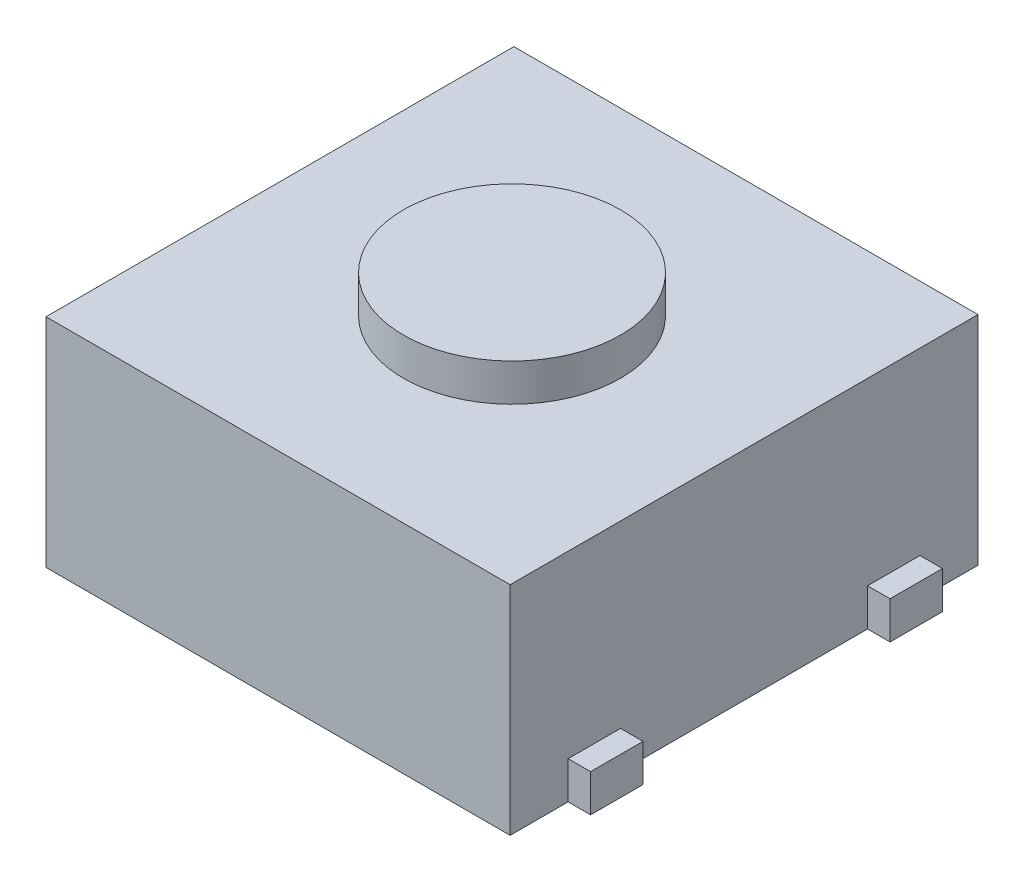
ISO-10303-21;
HEADER;
FILE_DESCRIPTION(('STEP AP214'),'2;1');
FILE_NAME('part.step','',(''),(''),'','','');
FILE_SCHEMA(('AUTOMOTIVE_DESIGN { 1 0 10303 214 1 1 1 1 }'));
ENDSEC;
DATA;
#1=APPLICATION_CONTEXT('core data for automotive mechanical design processes');
#2=APPLICATION_PROTOCOL_DEFINITION('international standard','automotive_design',2000,#1);
#3=PRODUCT_CONTEXT('',#1,'mechanical');
#4=PRODUCT('Part','Part','',(#3));
#5=PRODUCT_RELATED_PRODUCT_CATEGORY('part','',(#4));
#6=PRODUCT_DEFINITION_FORMATION('','',#4);
#7=PRODUCT_DEFINITION_CONTEXT('part definition',#1,'design');
#8=PRODUCT_DEFINITION('design','',#6,#7);
#9=PRODUCT_DEFINITION_SHAPE('','',#8);
#10=(LENGTH_UNIT() NAMED_UNIT(*) SI_UNIT(.MILLI.,.METRE.));
#11=(NAMED_UNIT(*) PLANE_ANGLE_UNIT() SI_UNIT($,.RADIAN.));
#12=(NAMED_UNIT(*) SI_UNIT($,.STERADIAN.) SOLID_ANGLE_UNIT());
#13=UNCERTAINTY_MEASURE_WITH_UNIT(LENGTH_MEASURE(1.E-05),#10,'distance_accuracy_value','');
#14=(GEOMETRIC_REPRESENTATION_CONTEXT(3) GLOBAL_UNCERTAINTY_ASSIGNED_CONTEXT((#13)) GLOBAL_UNIT_ASSIGNED_CONTEXT((#10,
#11,#12)) REPRESENTATION_CONTEXT('',''));
#15=CARTESIAN_POINT('',(0.,0.,0.));
#16=DIRECTION('',(0.,0.,1.));
#17=DIRECTION('',(1.,0.,0.));
#18=AXIS2_PLACEMENT_3D('',#15,#16,#17);
#19=CARTESIAN_POINT('',(0.,2.9,0.));
#20=DIRECTION('',(1.,0.,0.));
#21=DIRECTION('',(0.,0.,-1.));
#22=AXIS2_PLACEMENT_3D('',#19,#20,#21);
#23=PLANE('',#22);
#24=DIRECTION('',(0.,0.,-1.));
#25=VECTOR('',#24,1.);
#26=CARTESIAN_POINT('',(0.,0.5,0.));
#27=LINE('',#26,#25);
#28=CARTESIAN_POINT('',(0.,0.5,-4.775));
#29=VERTEX_POINT('',#28);
#30=CARTESIAN_POINT('',(0.,0.5,-5.475));
#31=VERTEX_POINT('',#30);
#32=EDGE_CURVE('E55',#29,#31,#27,.T.);
#33=ORIENTED_EDGE('',*,*,#32,.F.);
#34=DIRECTION('',(0.,-1.,0.));
#35=VECTOR('',#34,1.);
#36=CARTESIAN_POINT('',(0.,0.5,-4.775));
#37=LINE('',#36,#35);
#38=CARTESIAN_POINT('',(0.,0.,-4.775));
#39=VERTEX_POINT('',#38);
#40=EDGE_CURVE('E207',#29,#39,#37,.T.);
#41=ORIENTED_EDGE('',*,*,#40,.T.);
#42=DIRECTION('',(0.,0.,1.));
#43=VECTOR('',#42,1.);
#44=CARTESIAN_POINT('',(0.,0.,0.));
#45=LINE('',#44,#43);
#46=CARTESIAN_POINT('',(0.,0.,-1.475));
#47=VERTEX_POINT('',#46);
#48=EDGE_CURVE('E309',#39,#47,#45,.T.);
#49=ORIENTED_EDGE('',*,*,#48,.T.);
#50=DIRECTION('',(0.,-1.,0.));
#51=VECTOR('',#50,1.);
#52=CARTESIAN_POINT('',(0.,0.5,-1.475));
#53=LINE('',#52,#51);
#54=CARTESIAN_POINT('',(0.,0.5,-1.475));
#55=VERTEX_POINT('',#54);
#56=EDGE_CURVE('E233',#55,#47,#53,.T.);
#57=ORIENTED_EDGE('',*,*,#56,.F.);
#58=DIRECTION('',(0.,0.,-1.));
#59=VECTOR('',#58,1.);
#60=CARTESIAN_POINT('',(0.,0.5,0.));
#61=LINE('',#60,#59);
#62=CARTESIAN_POINT('',(0.,0.5,-0.775));
#63=VERTEX_POINT('',#62);
#64=EDGE_CURVE('E215',#63,#55,#61,.T.);
#65=ORIENTED_EDGE('',*,*,#64,.F.);
#66=DIRECTION('',(0.,-1.,0.));
#67=VECTOR('',#66,1.);
#68=CARTESIAN_POINT('',(0.,0.5,-0.775));
#69=LINE('',#68,#67);
#70=CARTESIAN_POINT('',(0.,0.,-0.775));
#71=VERTEX_POINT('',#70);
#72=EDGE_CURVE('E230',#63,#71,#69,.T.);
#73=ORIENTED_EDGE('',*,*,#72,.T.);
#74=CARTESIAN_POINT('',(0.,0.,0.));
#75=VERTEX_POINT('',#74);
#76=EDGE_CURVE('E286',#71,#75,#45,.T.);
#77=ORIENTED_EDGE('',*,*,#76,.T.);
#78=DIRECTION('',(0.,-1.,0.));
#79=VECTOR('',#78,1.);
#80=CARTESIAN_POINT('',(0.,2.9,0.));
#81=LINE('',#80,#79);
#82=CARTESIAN_POINT('',(0.,2.9,0.));
#83=VERTEX_POINT('',#82);
#84=EDGE_CURVE('E44',#83,#75,#81,.T.);
#85=ORIENTED_EDGE('',*,*,#84,.F.);
#86=DIRECTION('',(0.,0.,1.));
#87=VECTOR('',#86,1.);
#88=CARTESIAN_POINT('',(0.,2.9,0.));
#89=LINE('',#88,#87);
#90=CARTESIAN_POINT('',(0.,2.9,-6.25));
#91=VERTEX_POINT('',#90);
#92=EDGE_CURVE('E295',#91,#83,#89,.T.);
#93=ORIENTED_EDGE('',*,*,#92,.F.);
#94=DIRECTION('',(0.,-1.,0.));
#95=VECTOR('',#94,1.);
#96=CARTESIAN_POINT('',(0.,2.9,-6.25));
#97=LINE('',#96,#95);
#98=CARTESIAN_POINT('',(0.,0.,-6.25));
#99=VERTEX_POINT('',#98);
#100=EDGE_CURVE('E305',#91,#99,#97,.T.);
#101=ORIENTED_EDGE('',*,*,#100,.T.);
#102=CARTESIAN_POINT('',(0.,0.,-5.475));
#103=VERTEX_POINT('',#102);
#104=EDGE_CURVE('E306',#99,#103,#45,.T.);
#105=ORIENTED_EDGE('',*,*,#104,.T.);
#106=DIRECTION('',(0.,-1.,0.));
#107=VECTOR('',#106,1.);
#108=CARTESIAN_POINT('',(0.,0.5,-5.475));
#109=LINE('',#108,#107);
#110=EDGE_CURVE('E51',#31,#103,#109,.T.);
#111=ORIENTED_EDGE('',*,*,#110,.F.);
#112=EDGE_LOOP('',(#33,#41,#49,#57,#65,#73,#77,#85,#93,#101,#105,#111));
#113=FACE_BOUND('',#112,.T.);
#114=ADVANCED_FACE('F37',(#113),#23,.F.);
#115=CARTESIAN_POINT('',(6.2,2.9,0.));
#116=DIRECTION('',(-1.,0.,0.));
#117=DIRECTION('',(0.,0.,1.));
#118=AXIS2_PLACEMENT_3D('',#115,#116,#117);
#119=PLANE('',#118);
#120=DIRECTION('',(0.,0.,1.));
#121=VECTOR('',#120,1.);
#122=CARTESIAN_POINT('',(6.2,0.5,0.));
#123=LINE('',#122,#121);
#124=CARTESIAN_POINT('',(6.2,0.5,-1.475));
#125=VERTEX_POINT('',#124);
#126=CARTESIAN_POINT('',(6.2,0.5,-0.775));
#127=VERTEX_POINT('',#126);
#128=EDGE_CURVE('E243',#125,#127,#123,.T.);
#129=ORIENTED_EDGE('',*,*,#128,.F.);
#130=DIRECTION('',(0.,-1.,0.));
#131=VECTOR('',#130,1.);
#132=CARTESIAN_POINT('',(6.2,0.5,-1.475));
#133=LINE('',#132,#131);
#134=CARTESIAN_POINT('',(6.2,0.,-1.475));
#135=VERTEX_POINT('',#134);
#136=EDGE_CURVE('E259',#125,#135,#133,.T.);
#137=ORIENTED_EDGE('',*,*,#136,.T.);
#138=DIRECTION('',(0.,0.,-1.));
#139=VECTOR('',#138,1.);
#140=CARTESIAN_POINT('',(6.2,0.,0.));
#141=LINE('',#140,#139);
#142=CARTESIAN_POINT('',(6.2,0.,-4.775));
#143=VERTEX_POINT('',#142);
#144=EDGE_CURVE('E314',#135,#143,#141,.T.);
#145=ORIENTED_EDGE('',*,*,#144,.T.);
#146=DIRECTION('',(0.,-1.,0.));
#147=VECTOR('',#146,1.);
#148=CARTESIAN_POINT('',(6.2,0.5,-4.775));
#149=LINE('',#148,#147);
#150=CARTESIAN_POINT('',(6.2,0.5,-4.775));
#151=VERTEX_POINT('',#150);
#152=EDGE_CURVE('E290',#151,#143,#149,.T.);
#153=ORIENTED_EDGE('',*,*,#152,.F.);
#154=DIRECTION('',(0.,0.,1.));
#155=VECTOR('',#154,1.);
#156=CARTESIAN_POINT('',(6.2,0.5,0.));
#157=LINE('',#156,#155);
#158=CARTESIAN_POINT('',(6.2,0.5,-5.475));
#159=VERTEX_POINT('',#158);
#160=EDGE_CURVE('E272',#159,#151,#157,.T.);
#161=ORIENTED_EDGE('',*,*,#160,.F.);
#162=DIRECTION('',(0.,-1.,0.));
#163=VECTOR('',#162,1.);
#164=CARTESIAN_POINT('',(6.2,0.5,-5.475));
#165=LINE('',#164,#163);
#166=CARTESIAN_POINT('',(6.2,0.,-5.475));
#167=VERTEX_POINT('',#166);
#168=EDGE_CURVE('E287',#159,#167,#165,.T.);
#169=ORIENTED_EDGE('',*,*,#168,.T.);
#170=CARTESIAN_POINT('',(6.2,0.,-6.25));
#171=VERTEX_POINT('',#170);
#172=EDGE_CURVE('E311',#167,#171,#141,.T.);
#173=ORIENTED_EDGE('',*,*,#172,.T.);
#174=DIRECTION('',(0.,-1.,0.));
#175=VECTOR('',#174,1.);
#176=CARTESIAN_POINT('',(6.2,2.9,-6.25));
#177=LINE('',#176,#175);
#178=CARTESIAN_POINT('',(6.2,2.9,-6.25));
#179=VERTEX_POINT('',#178);
#180=EDGE_CURVE('E318',#179,#171,#177,.T.);
#181=ORIENTED_EDGE('',*,*,#180,.F.);
#182=DIRECTION('',(0.,0.,-1.));
#183=VECTOR('',#182,1.);
#184=CARTESIAN_POINT('',(6.2,2.9,0.));
#185=LINE('',#184,#183);
#186=CARTESIAN_POINT('',(6.2,2.9,0.));
#187=VERTEX_POINT('',#186);
#188=EDGE_CURVE('E301',#187,#179,#185,.T.);
#189=ORIENTED_EDGE('',*,*,#188,.F.);
#190=DIRECTION('',(0.,-1.,0.));
#191=VECTOR('',#190,1.);
#192=CARTESIAN_POINT('',(6.2,2.9,0.));
#193=LINE('',#192,#191);
#194=CARTESIAN_POINT('',(6.2,0.,0.));
#195=VERTEX_POINT('',#194);
#196=EDGE_CURVE('E321',#187,#195,#193,.T.);
#197=ORIENTED_EDGE('',*,*,#196,.T.);
#198=CARTESIAN_POINT('',(6.2,0.,-0.775));
#199=VERTEX_POINT('',#198);
#200=EDGE_CURVE('E312',#195,#199,#141,.T.);
#201=ORIENTED_EDGE('',*,*,#200,.T.);
#202=DIRECTION('',(0.,-1.,0.));
#203=VECTOR('',#202,1.);
#204=CARTESIAN_POINT('',(6.2,0.5,-0.775));
#205=LINE('',#204,#203);
#206=EDGE_CURVE('E262',#127,#199,#205,.T.);
#207=ORIENTED_EDGE('',*,*,#206,.F.);
#208=EDGE_LOOP('',(#129,#137,#145,#153,#161,#169,#173,#181,#189,#197,#201,#207));
#209=FACE_BOUND('',#208,.T.);
#210=ADVANCED_FACE('F339',(#209),#119,.F.);
#211=CARTESIAN_POINT('',(0.,2.9,0.));
#212=DIRECTION('',(0.,0.,-1.));
#213=DIRECTION('',(-1.,0.,0.));
#214=AXIS2_PLACEMENT_3D('',#211,#212,#213);
#215=PLANE('',#214);
#216=DIRECTION('',(1.,0.,0.));
#217=VECTOR('',#216,1.);
#218=CARTESIAN_POINT('',(0.,0.,0.));
#219=LINE('',#218,#217);
#220=EDGE_CURVE('E308',#75,#195,#219,.T.);
#221=ORIENTED_EDGE('',*,*,#220,.T.);
#222=ORIENTED_EDGE('',*,*,#196,.F.);
#223=DIRECTION('',(1.,0.,0.));
#224=VECTOR('',#223,1.);
#225=CARTESIAN_POINT('',(0.,2.9,0.));
#226=LINE('',#225,#224);
#227=EDGE_CURVE('E298',#83,#187,#226,.T.);
#228=ORIENTED_EDGE('',*,*,#227,.F.);
#229=ORIENTED_EDGE('',*,*,#84,.T.);
#230=EDGE_LOOP('',(#221,#222,#228,#229));
#231=FACE_BOUND('',#230,.T.);
#232=ADVANCED_FACE('F326',(#231),#215,.F.);
#233=CARTESIAN_POINT('',(0.,2.9,-6.25));
#234=DIRECTION('',(0.,0.,1.));
#235=DIRECTION('',(1.,0.,0.));
#236=AXIS2_PLACEMENT_3D('',#233,#234,#235);
#237=PLANE('',#236);
#238=DIRECTION('',(-1.,0.,0.));
#239=VECTOR('',#238,1.);
#240=CARTESIAN_POINT('',(0.,0.,-6.25));
#241=LINE('',#240,#239);
#242=EDGE_CURVE('E299',#171,#99,#241,.T.);
#243=ORIENTED_EDGE('',*,*,#242,.T.);
#244=ORIENTED_EDGE('',*,*,#100,.F.);
#245=DIRECTION('',(-1.,0.,0.));
#246=VECTOR('',#245,1.);
#247=CARTESIAN_POINT('',(0.,2.9,-6.25));
#248=LINE('',#247,#246);
#249=EDGE_CURVE('E303',#179,#91,#248,.T.);
#250=ORIENTED_EDGE('',*,*,#249,.F.);
#251=ORIENTED_EDGE('',*,*,#180,.T.);
#252=EDGE_LOOP('',(#243,#244,#250,#251));
#253=FACE_BOUND('',#252,.T.);
#254=ADVANCED_FACE('F363',(#253),#237,.F.);
#255=CARTESIAN_POINT('',(0.,2.9,0.));
#256=DIRECTION('',(0.,-1.,0.));
#257=DIRECTION('',(0.,0.,-1.));
#258=AXIS2_PLACEMENT_3D('',#255,#256,#257);
#259=PLANE('',#258);
#260=CARTESIAN_POINT('',(3.1,2.9,-3.125));
#261=DIRECTION('',(0.,-1.,0.));
#262=DIRECTION('',(0.,0.,-1.));
#263=AXIS2_PLACEMENT_3D('',#260,#261,#262);
#264=CIRCLE('',#263,1.45);
#265=CARTESIAN_POINT('',(3.1,2.9,-4.575));
#266=VERTEX_POINT('',#265);
#267=EDGE_CURVE('E12',#266,#266,#264,.F.);
#268=ORIENTED_EDGE('',*,*,#267,.F.);
#269=EDGE_LOOP('',(#268));
#270=FACE_BOUND('',#269,.T.);
#271=ORIENTED_EDGE('',*,*,#92,.T.);
#272=ORIENTED_EDGE('',*,*,#227,.T.);
#273=ORIENTED_EDGE('',*,*,#188,.T.);
#274=ORIENTED_EDGE('',*,*,#249,.T.);
#275=EDGE_LOOP('',(#271,#272,#273,#274));
#276=FACE_BOUND('',#275,.T.);
#277=ADVANCED_FACE('F404',(#270,#276),#259,.F.);
#278=CARTESIAN_POINT('',(0.,0.,0.));
#279=DIRECTION('',(0.,-1.,0.));
#280=DIRECTION('',(0.,0.,-1.));
#281=AXIS2_PLACEMENT_3D('',#278,#279,#280);
#282=PLANE('',#281);
#283=ORIENTED_EDGE('',*,*,#104,.F.);
#284=ORIENTED_EDGE('',*,*,#242,.F.);
#285=ORIENTED_EDGE('',*,*,#172,.F.);
#286=DIRECTION('',(1.,0.,0.));
#287=VECTOR('',#286,1.);
#288=CARTESIAN_POINT('',(0.,0.,-5.47499999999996));
#289=LINE('',#288,#287);
#290=CARTESIAN_POINT('',(6.5,0.,-5.475));
#291=VERTEX_POINT('',#290);
#292=EDGE_CURVE('E270',#167,#291,#289,.T.);
#293=ORIENTED_EDGE('',*,*,#292,.T.);
#294=DIRECTION('',(0.,0.,-1.));
#295=VECTOR('',#294,1.);
#296=CARTESIAN_POINT('',(6.50000000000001,0.,0.));
#297=LINE('',#296,#295);
#298=CARTESIAN_POINT('',(6.5,0.,-4.775));
#299=VERTEX_POINT('',#298);
#300=EDGE_CURVE('E258',#299,#291,#297,.T.);
#301=ORIENTED_EDGE('',*,*,#300,.F.);
#302=DIRECTION('',(1.,0.,0.));
#303=VECTOR('',#302,1.);
#304=CARTESIAN_POINT('',(0.,0.,-4.77499999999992));
#305=LINE('',#304,#303);
#306=EDGE_CURVE('E280',#143,#299,#305,.T.);
#307=ORIENTED_EDGE('',*,*,#306,.F.);
#308=ORIENTED_EDGE('',*,*,#144,.F.);
#309=DIRECTION('',(1.,0.,0.));
#310=VECTOR('',#309,1.);
#311=CARTESIAN_POINT('',(0.,0.,-1.47500000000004));
#312=LINE('',#311,#310);
#313=CARTESIAN_POINT('',(6.5,0.,-1.475));
#314=VERTEX_POINT('',#313);
#315=EDGE_CURVE('E241',#135,#314,#312,.T.);
#316=ORIENTED_EDGE('',*,*,#315,.T.);
#317=DIRECTION('',(0.,0.,-1.));
#318=VECTOR('',#317,1.);
#319=CARTESIAN_POINT('',(6.5,0.,0.));
#320=LINE('',#319,#318);
#321=CARTESIAN_POINT('',(6.5,0.,-0.775));
#322=VERTEX_POINT('',#321);
#323=EDGE_CURVE('E229',#322,#314,#320,.T.);
#324=ORIENTED_EDGE('',*,*,#323,.F.);
#325=DIRECTION('',(1.,0.,0.));
#326=VECTOR('',#325,1.);
#327=CARTESIAN_POINT('',(0.,0.,-0.775));
#328=LINE('',#327,#326);
#329=EDGE_CURVE('E252',#199,#322,#328,.T.);
#330=ORIENTED_EDGE('',*,*,#329,.F.);
#331=ORIENTED_EDGE('',*,*,#200,.F.);
#332=ORIENTED_EDGE('',*,*,#220,.F.);
#333=ORIENTED_EDGE('',*,*,#76,.F.);
#334=DIRECTION('',(-1.,0.,0.));
#335=VECTOR('',#334,1.);
#336=CARTESIAN_POINT('',(0.,0.,-0.775));
#337=LINE('',#336,#335);
#338=CARTESIAN_POINT('',(-0.299999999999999,0.,-0.775));
#339=VERTEX_POINT('',#338);
#340=EDGE_CURVE('E213',#71,#339,#337,.T.);
#341=ORIENTED_EDGE('',*,*,#340,.T.);
#342=DIRECTION('',(0.,0.,1.));
#343=VECTOR('',#342,1.);
#344=CARTESIAN_POINT('',(-0.299999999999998,0.,0.));
#345=LINE('',#344,#343);
#346=CARTESIAN_POINT('',(-0.299999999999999,0.,-1.475));
#347=VERTEX_POINT('',#346);
#348=EDGE_CURVE('E206',#347,#339,#345,.T.);
#349=ORIENTED_EDGE('',*,*,#348,.F.);
#350=DIRECTION('',(-1.,0.,0.));
#351=VECTOR('',#350,1.);
#352=CARTESIAN_POINT('',(0.,0.,-1.475));
#353=LINE('',#352,#351);
#354=EDGE_CURVE('E223',#47,#347,#353,.T.);
#355=ORIENTED_EDGE('',*,*,#354,.F.);
#356=ORIENTED_EDGE('',*,*,#48,.F.);
#357=DIRECTION('',(-1.,0.,0.));
#358=VECTOR('',#357,1.);
#359=CARTESIAN_POINT('',(0.,0.,-4.775));
#360=LINE('',#359,#358);
#361=CARTESIAN_POINT('',(-0.299999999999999,0.,-4.775));
#362=VERTEX_POINT('',#361);
#363=EDGE_CURVE('E193',#39,#362,#360,.T.);
#364=ORIENTED_EDGE('',*,*,#363,.T.);
#365=DIRECTION('',(0.,0.,1.));
#366=VECTOR('',#365,1.);
#367=CARTESIAN_POINT('',(-0.300000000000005,0.,0.));
#368=LINE('',#367,#366);
#369=CARTESIAN_POINT('',(-0.299999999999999,0.,-5.475));
#370=VERTEX_POINT('',#369);
#371=EDGE_CURVE('E202',#370,#362,#368,.T.);
#372=ORIENTED_EDGE('',*,*,#371,.F.);
#373=DIRECTION('',(-1.,0.,0.));
#374=VECTOR('',#373,1.);
#375=CARTESIAN_POINT('',(0.,0.,-5.475));
#376=LINE('',#375,#374);
#377=EDGE_CURVE('E184',#103,#370,#376,.T.);
#378=ORIENTED_EDGE('',*,*,#377,.F.);
#379=EDGE_LOOP('',(#283,#284,#285,#293,#301,#307,#308,#316,#324,#330,#331,#332,#333,#341,#349,
#355,#356,#364,#372,#378));
#380=FACE_BOUND('',#379,.T.);
#381=ADVANCED_FACE('F335',(#380),#282,.T.);
#382=CARTESIAN_POINT('',(6.50000000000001,0.5,0.));
#383=DIRECTION('',(-1.,0.,0.));
#384=DIRECTION('',(0.,0.,1.));
#385=AXIS2_PLACEMENT_3D('',#382,#383,#384);
#386=PLANE('',#385);
#387=ORIENTED_EDGE('',*,*,#300,.T.);
#388=DIRECTION('',(0.,-1.,0.));
#389=VECTOR('',#388,1.);
#390=CARTESIAN_POINT('',(6.5,0.5,-5.475));
#391=LINE('',#390,#389);
#392=CARTESIAN_POINT('',(6.5,0.5,-5.475));
#393=VERTEX_POINT('',#392);
#394=EDGE_CURVE('E284',#393,#291,#391,.T.);
#395=ORIENTED_EDGE('',*,*,#394,.F.);
#396=DIRECTION('',(0.,0.,-1.));
#397=VECTOR('',#396,1.);
#398=CARTESIAN_POINT('',(6.50000000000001,0.5,0.));
#399=LINE('',#398,#397);
#400=CARTESIAN_POINT('',(6.5,0.5,-4.775));
#401=VERTEX_POINT('',#400);
#402=EDGE_CURVE('E267',#401,#393,#399,.T.);
#403=ORIENTED_EDGE('',*,*,#402,.F.);
#404=DIRECTION('',(0.,-1.,0.));
#405=VECTOR('',#404,1.);
#406=CARTESIAN_POINT('',(6.5,0.5,-4.775));
#407=LINE('',#406,#405);
#408=EDGE_CURVE('E277',#401,#299,#407,.T.);
#409=ORIENTED_EDGE('',*,*,#408,.T.);
#410=EDGE_LOOP('',(#387,#395,#403,#409));
#411=FACE_BOUND('',#410,.T.);
#412=ADVANCED_FACE('F407',(#411),#386,.F.);
#413=CARTESIAN_POINT('',(0.,0.5,-5.47499999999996));
#414=DIRECTION('',(0.,0.,-1.));
#415=DIRECTION('',(-1.,0.,0.));
#416=AXIS2_PLACEMENT_3D('',#413,#414,#415);
#417=PLANE('',#416);
#418=ORIENTED_EDGE('',*,*,#292,.F.);
#419=ORIENTED_EDGE('',*,*,#168,.F.);
#420=DIRECTION('',(1.,0.,0.));
#421=VECTOR('',#420,1.);
#422=CARTESIAN_POINT('',(0.,0.5,-5.47499999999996));
#423=LINE('',#422,#421);
#424=EDGE_CURVE('E274',#159,#393,#423,.T.);
#425=ORIENTED_EDGE('',*,*,#424,.T.);
#426=ORIENTED_EDGE('',*,*,#394,.T.);
#427=EDGE_LOOP('',(#418,#419,#425,#426));
#428=FACE_BOUND('',#427,.T.);
#429=ADVANCED_FACE('F413',(#428),#417,.T.);
#430=CARTESIAN_POINT('',(0.,0.5,-4.77499999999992));
#431=DIRECTION('',(0.,0.,-1.));
#432=DIRECTION('',(-1.,0.,0.));
#433=AXIS2_PLACEMENT_3D('',#430,#431,#432);
#434=PLANE('',#433);
#435=ORIENTED_EDGE('',*,*,#306,.T.);
#436=ORIENTED_EDGE('',*,*,#408,.F.);
#437=DIRECTION('',(1.,0.,0.));
#438=VECTOR('',#437,1.);
#439=CARTESIAN_POINT('',(0.,0.5,-4.77499999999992));
#440=LINE('',#439,#438);
#441=EDGE_CURVE('E269',#151,#401,#440,.T.);
#442=ORIENTED_EDGE('',*,*,#441,.F.);
#443=ORIENTED_EDGE('',*,*,#152,.T.);
#444=EDGE_LOOP('',(#435,#436,#442,#443));
#445=FACE_BOUND('',#444,.T.);
#446=ADVANCED_FACE('F415',(#445),#434,.F.);
#447=CARTESIAN_POINT('',(0.,0.5,0.));
#448=DIRECTION('',(0.,-1.,0.));
#449=DIRECTION('',(0.,0.,-1.));
#450=AXIS2_PLACEMENT_3D('',#447,#448,#449);
#451=PLANE('',#450);
#452=ORIENTED_EDGE('',*,*,#402,.T.);
#453=ORIENTED_EDGE('',*,*,#424,.F.);
#454=ORIENTED_EDGE('',*,*,#160,.T.);
#455=ORIENTED_EDGE('',*,*,#441,.T.);
#456=EDGE_LOOP('',(#452,#453,#454,#455));
#457=FACE_BOUND('',#456,.T.);
#458=ADVANCED_FACE('F418',(#457),#451,.F.);
#459=CARTESIAN_POINT('',(6.5,0.5,0.));
#460=DIRECTION('',(-1.,0.,0.));
#461=DIRECTION('',(0.,0.,1.));
#462=AXIS2_PLACEMENT_3D('',#459,#460,#461);
#463=PLANE('',#462);
#464=ORIENTED_EDGE('',*,*,#323,.T.);
#465=DIRECTION('',(0.,-1.,0.));
#466=VECTOR('',#465,1.);
#467=CARTESIAN_POINT('',(6.5,0.5,-1.475));
#468=LINE('',#467,#466);
#469=CARTESIAN_POINT('',(6.5,0.5,-1.475));
#470=VERTEX_POINT('',#469);
#471=EDGE_CURVE('E256',#470,#314,#468,.T.);
#472=ORIENTED_EDGE('',*,*,#471,.F.);
#473=DIRECTION('',(0.,0.,-1.));
#474=VECTOR('',#473,1.);
#475=CARTESIAN_POINT('',(6.5,0.5,0.));
#476=LINE('',#475,#474);
#477=CARTESIAN_POINT('',(6.5,0.5,-0.775));
#478=VERTEX_POINT('',#477);
#479=EDGE_CURVE('E238',#478,#470,#476,.T.);
#480=ORIENTED_EDGE('',*,*,#479,.F.);
#481=DIRECTION('',(0.,-1.,0.));
#482=VECTOR('',#481,1.);
#483=CARTESIAN_POINT('',(6.5,0.5,-0.775));
#484=LINE('',#483,#482);
#485=EDGE_CURVE('E249',#478,#322,#484,.T.);
#486=ORIENTED_EDGE('',*,*,#485,.T.);
#487=EDGE_LOOP('',(#464,#472,#480,#486));
#488=FACE_BOUND('',#487,.T.);
#489=ADVANCED_FACE('F425',(#488),#463,.F.);
#490=CARTESIAN_POINT('',(0.,0.5,-1.47500000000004));
#491=DIRECTION('',(0.,0.,-1.));
#492=DIRECTION('',(-1.,0.,0.));
#493=AXIS2_PLACEMENT_3D('',#490,#491,#492);
#494=PLANE('',#493);
#495=ORIENTED_EDGE('',*,*,#315,.F.);
#496=ORIENTED_EDGE('',*,*,#136,.F.);
#497=DIRECTION('',(1.,0.,0.));
#498=VECTOR('',#497,1.);
#499=CARTESIAN_POINT('',(0.,0.5,-1.47500000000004));
#500=LINE('',#499,#498);
#501=EDGE_CURVE('E246',#125,#470,#500,.T.);
#502=ORIENTED_EDGE('',*,*,#501,.T.);
#503=ORIENTED_EDGE('',*,*,#471,.T.);
#504=EDGE_LOOP('',(#495,#496,#502,#503));
#505=FACE_BOUND('',#504,.T.);
#506=ADVANCED_FACE('F353',(#505),#494,.T.);
#507=CARTESIAN_POINT('',(0.,0.5,-0.775));
#508=DIRECTION('',(0.,0.,-1.));
#509=DIRECTION('',(-1.,0.,0.));
#510=AXIS2_PLACEMENT_3D('',#507,#508,#509);
#511=PLANE('',#510);
#512=ORIENTED_EDGE('',*,*,#329,.T.);
#513=ORIENTED_EDGE('',*,*,#485,.F.);
#514=DIRECTION('',(1.,0.,0.));
#515=VECTOR('',#514,1.);
#516=CARTESIAN_POINT('',(0.,0.5,-0.775));
#517=LINE('',#516,#515);
#518=EDGE_CURVE('E240',#127,#478,#517,.T.);
#519=ORIENTED_EDGE('',*,*,#518,.F.);
#520=ORIENTED_EDGE('',*,*,#206,.T.);
#521=EDGE_LOOP('',(#512,#513,#519,#520));
#522=FACE_BOUND('',#521,.T.);
#523=ADVANCED_FACE('F343',(#522),#511,.F.);
#524=CARTESIAN_POINT('',(0.,0.5,0.));
#525=DIRECTION('',(0.,-1.,0.));
#526=DIRECTION('',(0.,0.,-1.));
#527=AXIS2_PLACEMENT_3D('',#524,#525,#526);
#528=PLANE('',#527);
#529=ORIENTED_EDGE('',*,*,#479,.T.);
#530=ORIENTED_EDGE('',*,*,#501,.F.);
#531=ORIENTED_EDGE('',*,*,#128,.T.);
#532=ORIENTED_EDGE('',*,*,#518,.T.);
#533=EDGE_LOOP('',(#529,#530,#531,#532));
#534=FACE_BOUND('',#533,.T.);
#535=ADVANCED_FACE('F347',(#534),#528,.F.);
#536=CARTESIAN_POINT('',(-0.299999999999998,0.5,0.));
#537=DIRECTION('',(1.,0.,0.));
#538=DIRECTION('',(0.,0.,-1.));
#539=AXIS2_PLACEMENT_3D('',#536,#537,#538);
#540=PLANE('',#539);
#541=ORIENTED_EDGE('',*,*,#348,.T.);
#542=DIRECTION('',(0.,-1.,0.));
#543=VECTOR('',#542,1.);
#544=CARTESIAN_POINT('',(-0.299999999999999,0.5,-0.775));
#545=LINE('',#544,#543);
#546=CARTESIAN_POINT('',(-0.299999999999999,0.5,-0.775));
#547=VERTEX_POINT('',#546);
#548=EDGE_CURVE('E227',#547,#339,#545,.T.);
#549=ORIENTED_EDGE('',*,*,#548,.F.);
#550=DIRECTION('',(0.,0.,1.));
#551=VECTOR('',#550,1.);
#552=CARTESIAN_POINT('',(-0.299999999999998,0.5,0.));
#553=LINE('',#552,#551);
#554=CARTESIAN_POINT('',(-0.299999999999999,0.5,-1.475));
#555=VERTEX_POINT('',#554);
#556=EDGE_CURVE('E210',#555,#547,#553,.T.);
#557=ORIENTED_EDGE('',*,*,#556,.F.);
#558=DIRECTION('',(0.,-1.,0.));
#559=VECTOR('',#558,1.);
#560=CARTESIAN_POINT('',(-0.299999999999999,0.5,-1.475));
#561=LINE('',#560,#559);
#562=EDGE_CURVE('E220',#555,#347,#561,.T.);
#563=ORIENTED_EDGE('',*,*,#562,.T.);
#564=EDGE_LOOP('',(#541,#549,#557,#563));
#565=FACE_BOUND('',#564,.T.);
#566=ADVANCED_FACE('F377',(#565),#540,.F.);
#567=CARTESIAN_POINT('',(0.,0.5,-0.775));
#568=DIRECTION('',(0.,0.,1.));
#569=DIRECTION('',(1.,0.,0.));
#570=AXIS2_PLACEMENT_3D('',#567,#568,#569);
#571=PLANE('',#570);
#572=ORIENTED_EDGE('',*,*,#340,.F.);
#573=ORIENTED_EDGE('',*,*,#72,.F.);
#574=DIRECTION('',(-1.,0.,0.));
#575=VECTOR('',#574,1.);
#576=CARTESIAN_POINT('',(0.,0.5,-0.775));
#577=LINE('',#576,#575);
#578=EDGE_CURVE('E217',#63,#547,#577,.T.);
#579=ORIENTED_EDGE('',*,*,#578,.T.);
#580=ORIENTED_EDGE('',*,*,#548,.T.);
#581=EDGE_LOOP('',(#572,#573,#579,#580));
#582=FACE_BOUND('',#581,.T.);
#583=ADVANCED_FACE('F383',(#582),#571,.T.);
#584=CARTESIAN_POINT('',(0.,0.5,-1.475));
#585=DIRECTION('',(0.,0.,1.));
#586=DIRECTION('',(1.,0.,0.));
#587=AXIS2_PLACEMENT_3D('',#584,#585,#586);
#588=PLANE('',#587);
#589=ORIENTED_EDGE('',*,*,#354,.T.);
#590=ORIENTED_EDGE('',*,*,#562,.F.);
#591=DIRECTION('',(-1.,0.,0.));
#592=VECTOR('',#591,1.);
#593=CARTESIAN_POINT('',(0.,0.5,-1.475));
#594=LINE('',#593,#592);
#595=EDGE_CURVE('E212',#55,#555,#594,.T.);
#596=ORIENTED_EDGE('',*,*,#595,.F.);
#597=ORIENTED_EDGE('',*,*,#56,.T.);
#598=EDGE_LOOP('',(#589,#590,#596,#597));
#599=FACE_BOUND('',#598,.T.);
#600=ADVANCED_FACE('F372',(#599),#588,.F.);
#601=CARTESIAN_POINT('',(0.,0.5,0.));
#602=DIRECTION('',(0.,-1.,0.));
#603=DIRECTION('',(0.,0.,-1.));
#604=AXIS2_PLACEMENT_3D('',#601,#602,#603);
#605=PLANE('',#604);
#606=ORIENTED_EDGE('',*,*,#556,.T.);
#607=ORIENTED_EDGE('',*,*,#578,.F.);
#608=ORIENTED_EDGE('',*,*,#64,.T.);
#609=ORIENTED_EDGE('',*,*,#595,.T.);
#610=EDGE_LOOP('',(#606,#607,#608,#609));
#611=FACE_BOUND('',#610,.T.);
#612=ADVANCED_FACE('F381',(#611),#605,.F.);
#613=CARTESIAN_POINT('',(-0.300000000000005,0.5,0.));
#614=DIRECTION('',(1.,0.,0.));
#615=DIRECTION('',(0.,0.,-1.));
#616=AXIS2_PLACEMENT_3D('',#613,#614,#615);
#617=PLANE('',#616);
#618=ORIENTED_EDGE('',*,*,#371,.T.);
#619=DIRECTION('',(0.,-1.,0.));
#620=VECTOR('',#619,1.);
#621=CARTESIAN_POINT('',(-0.299999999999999,0.5,-4.775));
#622=LINE('',#621,#620);
#623=CARTESIAN_POINT('',(-0.299999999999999,0.5,-4.775));
#624=VERTEX_POINT('',#623);
#625=EDGE_CURVE('E191',#624,#362,#622,.T.);
#626=ORIENTED_EDGE('',*,*,#625,.F.);
#627=DIRECTION('',(0.,0.,1.));
#628=VECTOR('',#627,1.);
#629=CARTESIAN_POINT('',(-0.300000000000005,0.5,0.));
#630=LINE('',#629,#628);
#631=CARTESIAN_POINT('',(-0.299999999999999,0.5,-5.475));
#632=VERTEX_POINT('',#631);
#633=EDGE_CURVE('E176',#632,#624,#630,.T.);
#634=ORIENTED_EDGE('',*,*,#633,.F.);
#635=DIRECTION('',(0.,-1.,0.));
#636=VECTOR('',#635,1.);
#637=CARTESIAN_POINT('',(-0.299999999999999,0.5,-5.475));
#638=LINE('',#637,#636);
#639=EDGE_CURVE('E181',#632,#370,#638,.T.);
#640=ORIENTED_EDGE('',*,*,#639,.T.);
#641=EDGE_LOOP('',(#618,#626,#634,#640));
#642=FACE_BOUND('',#641,.T.);
#643=ADVANCED_FACE('F190',(#642),#617,.F.);
#644=CARTESIAN_POINT('',(0.,0.5,-4.775));
#645=DIRECTION('',(0.,0.,1.));
#646=DIRECTION('',(1.,0.,0.));
#647=AXIS2_PLACEMENT_3D('',#644,#645,#646);
#648=PLANE('',#647);
#649=ORIENTED_EDGE('',*,*,#363,.F.);
#650=ORIENTED_EDGE('',*,*,#40,.F.);
#651=DIRECTION('',(-1.,0.,0.));
#652=VECTOR('',#651,1.);
#653=CARTESIAN_POINT('',(0.,0.5,-4.775));
#654=LINE('',#653,#652);
#655=EDGE_CURVE('E188',#29,#624,#654,.T.);
#656=ORIENTED_EDGE('',*,*,#655,.T.);
#657=ORIENTED_EDGE('',*,*,#625,.T.);
#658=EDGE_LOOP('',(#649,#650,#656,#657));
#659=FACE_BOUND('',#658,.T.);
#660=ADVANCED_FACE('F368',(#659),#648,.T.);
#661=CARTESIAN_POINT('',(0.,0.5,-5.475));
#662=DIRECTION('',(0.,0.,1.));
#663=DIRECTION('',(1.,0.,0.));
#664=AXIS2_PLACEMENT_3D('',#661,#662,#663);
#665=PLANE('',#664);
#666=ORIENTED_EDGE('',*,*,#377,.T.);
#667=ORIENTED_EDGE('',*,*,#639,.F.);
#668=DIRECTION('',(-1.,0.,0.));
#669=VECTOR('',#668,1.);
#670=CARTESIAN_POINT('',(0.,0.5,-5.475));
#671=LINE('',#670,#669);
#672=EDGE_CURVE('E171',#31,#632,#671,.T.);
#673=ORIENTED_EDGE('',*,*,#672,.F.);
#674=ORIENTED_EDGE('',*,*,#110,.T.);
#675=EDGE_LOOP('',(#666,#667,#673,#674));
#676=FACE_BOUND('',#675,.T.);
#677=ADVANCED_FACE('F182',(#676),#665,.F.);
#678=CARTESIAN_POINT('',(0.,0.5,0.));
#679=DIRECTION('',(0.,-1.,0.));
#680=DIRECTION('',(0.,0.,-1.));
#681=AXIS2_PLACEMENT_3D('',#678,#679,#680);
#682=PLANE('',#681);
#683=ORIENTED_EDGE('',*,*,#633,.T.);
#684=ORIENTED_EDGE('',*,*,#655,.F.);
#685=ORIENTED_EDGE('',*,*,#32,.T.);
#686=ORIENTED_EDGE('',*,*,#672,.T.);
#687=EDGE_LOOP('',(#683,#684,#685,#686));
#688=FACE_BOUND('',#687,.T.);
#689=ADVANCED_FACE('F173',(#688),#682,.F.);
#690=CARTESIAN_POINT('',(3.1,10.901219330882,-3.125));
#691=DIRECTION('',(0.,-1.,0.));
#692=DIRECTION('',(0.,0.,-1.));
#693=AXIS2_PLACEMENT_3D('',#690,#691,#692);
#694=CYLINDRICAL_SURFACE('',#693,1.45);
#695=CARTESIAN_POINT('',(3.1,3.4,-3.125));
#696=DIRECTION('',(0.,-1.,0.));
#697=DIRECTION('',(0.,0.,-1.));
#698=AXIS2_PLACEMENT_3D('',#695,#696,#697);
#699=CIRCLE('',#698,1.45);
#700=CARTESIAN_POINT('',(3.1,3.4,-4.575));
#701=VERTEX_POINT('',#700);
#702=EDGE_CURVE('E198',#701,#701,#699,.T.);
#703=ORIENTED_EDGE('',*,*,#702,.T.);
#704=EDGE_LOOP('',(#703));
#705=FACE_BOUND('',#704,.T.);
#706=ORIENTED_EDGE('',*,*,#267,.T.);
#707=EDGE_LOOP('',(#706));
#708=FACE_BOUND('',#707,.T.);
#709=ADVANCED_FACE('F495',(#705,#708),#694,.T.);
#710=CARTESIAN_POINT('',(0.,3.4,0.));
#711=DIRECTION('',(0.,-1.,0.));
#712=DIRECTION('',(0.,0.,-1.));
#713=AXIS2_PLACEMENT_3D('',#710,#711,#712);
#714=PLANE('',#713);
#715=ORIENTED_EDGE('',*,*,#702,.F.);
#716=EDGE_LOOP('',(#715));
#717=FACE_BOUND('',#716,.T.);
#718=ADVANCED_FACE('F512',(#717),#714,.F.);
#719=CLOSED_SHELL('',(#114,#210,#232,#254,#277,#381,#412,#429,#446,#458,#489,#506,#523,#535,
#566,#583,#600,#612,#643,#660,#677,#689,#709,#718));
#720=MANIFOLD_SOLID_BREP('B2',#719);
#721=ADVANCED_BREP_SHAPE_REPRESENTATION('',(#18,#720),#14);
#722=SHAPE_DEFINITION_REPRESENTATION(#9,#721);
ENDSEC;
END-ISO-10303-21;
